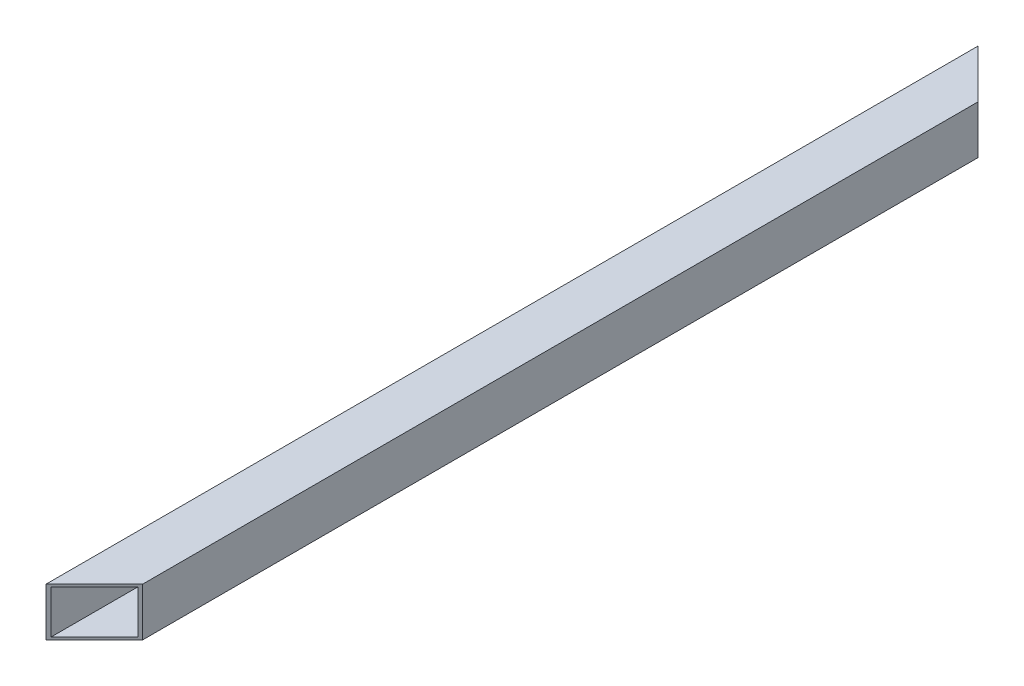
ISO-10303-21;
HEADER;
FILE_DESCRIPTION(('STEP AP214'),'2;1');
FILE_NAME('part.step','',(''),(''),'','','');
FILE_SCHEMA(('AUTOMOTIVE_DESIGN { 1 0 10303 214 1 1 1 1 }'));
ENDSEC;
DATA;
#1=APPLICATION_CONTEXT('core data for automotive mechanical design processes');
#2=APPLICATION_PROTOCOL_DEFINITION('international standard','automotive_design',2000,#1);
#3=PRODUCT_CONTEXT('',#1,'mechanical');
#4=PRODUCT('Part','Part','',(#3));
#5=PRODUCT_RELATED_PRODUCT_CATEGORY('part','',(#4));
#6=PRODUCT_DEFINITION_FORMATION('','',#4);
#7=PRODUCT_DEFINITION_CONTEXT('part definition',#1,'design');
#8=PRODUCT_DEFINITION('design','',#6,#7);
#9=PRODUCT_DEFINITION_SHAPE('','',#8);
#10=(LENGTH_UNIT() NAMED_UNIT(*) SI_UNIT(.MILLI.,.METRE.));
#11=(NAMED_UNIT(*) PLANE_ANGLE_UNIT() SI_UNIT($,.RADIAN.));
#12=(NAMED_UNIT(*) SI_UNIT($,.STERADIAN.) SOLID_ANGLE_UNIT());
#13=UNCERTAINTY_MEASURE_WITH_UNIT(LENGTH_MEASURE(1.E-05),#10,'distance_accuracy_value','');
#14=(GEOMETRIC_REPRESENTATION_CONTEXT(3) GLOBAL_UNCERTAINTY_ASSIGNED_CONTEXT((#13)) GLOBAL_UNIT_ASSIGNED_CONTEXT((#10,
#11,#12)) REPRESENTATION_CONTEXT('',''));
#15=CARTESIAN_POINT('',(0.,0.,0.));
#16=DIRECTION('',(0.,0.,1.));
#17=DIRECTION('',(1.,0.,0.));
#18=AXIS2_PLACEMENT_3D('',#15,#16,#17);
#19=CARTESIAN_POINT('',(-36.,36.,-40.));
#20=DIRECTION('',(1.,0.,0.));
#21=DIRECTION('',(0.,1.,0.));
#22=AXIS2_PLACEMENT_3D('',#19,#20,#21);
#23=PLANE('',#22);
#24=DIRECTION('',(0.,-1.,0.));
#25=VECTOR('',#24,1.);
#26=CARTESIAN_POINT('',(-36.,18.,-36.));
#27=LINE('',#26,#25);
#28=CARTESIAN_POINT('',(-36.,36.,-36.));
#29=VERTEX_POINT('',#28);
#30=CARTESIAN_POINT('',(-36.,-36.,-36.));
#31=VERTEX_POINT('',#30);
#32=EDGE_CURVE('E148',#29,#31,#27,.T.);
#33=ORIENTED_EDGE('',*,*,#32,.F.);
#34=DIRECTION('',(0.,0.,1.));
#35=VECTOR('',#34,1.);
#36=CARTESIAN_POINT('',(-36.,36.,-40.));
#37=LINE('',#36,#35);
#38=CARTESIAN_POINT('',(-36.,36.,1499.138438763));
#39=VERTEX_POINT('',#38);
#40=EDGE_CURVE('E10',#29,#39,#37,.T.);
#41=ORIENTED_EDGE('',*,*,#40,.T.);
#42=DIRECTION('',(0.,1.,0.));
#43=VECTOR('',#42,1.);
#44=CARTESIAN_POINT('',(-36.,18.,1499.138438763));
#45=LINE('',#44,#43);
#46=CARTESIAN_POINT('',(-36.,-36.,1499.138438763));
#47=VERTEX_POINT('',#46);
#48=EDGE_CURVE('E103',#47,#39,#45,.T.);
#49=ORIENTED_EDGE('',*,*,#48,.F.);
#50=DIRECTION('',(0.,0.,1.));
#51=VECTOR('',#50,1.);
#52=CARTESIAN_POINT('',(-36.,-36.,-40.));
#53=LINE('',#52,#51);
#54=EDGE_CURVE('E89',#31,#47,#53,.T.);
#55=ORIENTED_EDGE('',*,*,#54,.F.);
#56=EDGE_LOOP('',(#33,#41,#49,#55));
#57=FACE_BOUND('',#56,.T.);
#58=ADVANCED_FACE('F16',(#57),#23,.T.);
#59=CARTESIAN_POINT('',(36.,36.,-40.));
#60=DIRECTION('',(0.,-1.,0.));
#61=DIRECTION('',(0.,0.,-1.));
#62=AXIS2_PLACEMENT_3D('',#59,#60,#61);
#63=PLANE('',#62);
#64=DIRECTION('',(-0.707106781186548,0.,-0.707106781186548));
#65=VECTOR('',#64,1.);
#66=CARTESIAN_POINT('',(-1.,36.,-1.));
#67=LINE('',#66,#65);
#68=CARTESIAN_POINT('',(36.,36.,36.));
#69=VERTEX_POINT('',#68);
#70=EDGE_CURVE('E144',#69,#29,#67,.T.);
#71=ORIENTED_EDGE('',*,*,#70,.F.);
#72=DIRECTION('',(0.,0.,1.));
#73=VECTOR('',#72,1.);
#74=CARTESIAN_POINT('',(36.,36.,-40.));
#75=LINE('',#74,#73);
#76=CARTESIAN_POINT('',(36.,36.,1427.138438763));
#77=VERTEX_POINT('',#76);
#78=EDGE_CURVE('E24',#69,#77,#75,.T.);
#79=ORIENTED_EDGE('',*,*,#78,.T.);
#80=DIRECTION('',(0.707106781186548,0.,-0.707106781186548));
#81=VECTOR('',#80,1.);
#82=CARTESIAN_POINT('',(750.56921938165,36.,712.56921938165));
#83=LINE('',#82,#81);
#84=EDGE_CURVE('E134',#39,#77,#83,.T.);
#85=ORIENTED_EDGE('',*,*,#84,.F.);
#86=ORIENTED_EDGE('',*,*,#40,.F.);
#87=EDGE_LOOP('',(#71,#79,#85,#86));
#88=FACE_BOUND('',#87,.T.);
#89=ADVANCED_FACE('F208',(#88),#63,.T.);
#90=CARTESIAN_POINT('',(36.,-36.,-40.));
#91=DIRECTION('',(-1.,0.,0.));
#92=DIRECTION('',(0.,0.,1.));
#93=AXIS2_PLACEMENT_3D('',#90,#91,#92);
#94=PLANE('',#93);
#95=DIRECTION('',(0.,1.,0.));
#96=VECTOR('',#95,1.);
#97=CARTESIAN_POINT('',(36.,-18.,36.));
#98=LINE('',#97,#96);
#99=CARTESIAN_POINT('',(36.,-36.,36.));
#100=VERTEX_POINT('',#99);
#101=EDGE_CURVE('E129',#100,#69,#98,.T.);
#102=ORIENTED_EDGE('',*,*,#101,.F.);
#103=DIRECTION('',(0.,0.,1.));
#104=VECTOR('',#103,1.);
#105=CARTESIAN_POINT('',(36.,-36.,-40.));
#106=LINE('',#105,#104);
#107=CARTESIAN_POINT('',(36.,-36.,1427.138438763));
#108=VERTEX_POINT('',#107);
#109=EDGE_CURVE('E36',#100,#108,#106,.T.);
#110=ORIENTED_EDGE('',*,*,#109,.T.);
#111=DIRECTION('',(0.,-1.,0.));
#112=VECTOR('',#111,1.);
#113=CARTESIAN_POINT('',(36.,-18.,1427.138438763));
#114=LINE('',#113,#112);
#115=EDGE_CURVE('E138',#77,#108,#114,.T.);
#116=ORIENTED_EDGE('',*,*,#115,.F.);
#117=ORIENTED_EDGE('',*,*,#78,.F.);
#118=EDGE_LOOP('',(#102,#110,#116,#117));
#119=FACE_BOUND('',#118,.T.);
#120=ADVANCED_FACE('F213',(#119),#94,.T.);
#121=CARTESIAN_POINT('',(-36.,-36.,-40.));
#122=DIRECTION('',(0.,1.,0.));
#123=DIRECTION('',(1.,0.,0.));
#124=AXIS2_PLACEMENT_3D('',#121,#122,#123);
#125=PLANE('',#124);
#126=DIRECTION('',(0.707106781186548,0.,0.707106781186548));
#127=VECTOR('',#126,1.);
#128=CARTESIAN_POINT('',(-19.,-36.,-19.));
#129=LINE('',#128,#127);
#130=EDGE_CURVE('E119',#31,#100,#129,.T.);
#131=ORIENTED_EDGE('',*,*,#130,.F.);
#132=ORIENTED_EDGE('',*,*,#54,.T.);
#133=DIRECTION('',(-0.707106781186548,0.,0.707106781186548));
#134=VECTOR('',#133,1.);
#135=CARTESIAN_POINT('',(732.56921938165,-36.,730.56921938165));
#136=LINE('',#135,#134);
#137=EDGE_CURVE('E90',#108,#47,#136,.T.);
#138=ORIENTED_EDGE('',*,*,#137,.F.);
#139=ORIENTED_EDGE('',*,*,#109,.F.);
#140=EDGE_LOOP('',(#131,#132,#138,#139));
#141=FACE_BOUND('',#140,.T.);
#142=ADVANCED_FACE('F219',(#141),#125,.T.);
#143=CARTESIAN_POINT('',(40.,40.,-40.));
#144=DIRECTION('',(0.,-1.,0.));
#145=DIRECTION('',(0.,0.,-1.));
#146=AXIS2_PLACEMENT_3D('',#143,#144,#145);
#147=PLANE('',#146);
#148=DIRECTION('',(0.,0.,1.));
#149=VECTOR('',#148,1.);
#150=CARTESIAN_POINT('',(-40.,40.,-40.));
#151=LINE('',#150,#149);
#152=CARTESIAN_POINT('',(-40.,40.,-40.));
#153=VERTEX_POINT('',#152);
#154=CARTESIAN_POINT('',(-40.,40.,1503.1384388));
#155=VERTEX_POINT('',#154);
#156=EDGE_CURVE('E75',#153,#155,#151,.T.);
#157=ORIENTED_EDGE('',*,*,#156,.T.);
#158=DIRECTION('',(0.707106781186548,0.,-0.707106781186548));
#159=VECTOR('',#158,1.);
#160=CARTESIAN_POINT('',(751.56921938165,40.,711.56921938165));
#161=LINE('',#160,#159);
#162=CARTESIAN_POINT('',(40.,40.,1423.138438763));
#163=VERTEX_POINT('',#162);
#164=EDGE_CURVE('E80',#155,#163,#161,.T.);
#165=ORIENTED_EDGE('',*,*,#164,.T.);
#166=DIRECTION('',(0.,0.,1.));
#167=VECTOR('',#166,1.);
#168=CARTESIAN_POINT('',(40.,40.,-40.));
#169=LINE('',#168,#167);
#170=CARTESIAN_POINT('',(40.,40.,40.));
#171=VERTEX_POINT('',#170);
#172=EDGE_CURVE('E115',#171,#163,#169,.T.);
#173=ORIENTED_EDGE('',*,*,#172,.F.);
#174=DIRECTION('',(-0.707106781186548,0.,-0.707106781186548));
#175=VECTOR('',#174,1.);
#176=CARTESIAN_POINT('',(0.,40.,0.));
#177=LINE('',#176,#175);
#178=EDGE_CURVE('E84',#171,#153,#177,.T.);
#179=ORIENTED_EDGE('',*,*,#178,.T.);
#180=EDGE_LOOP('',(#157,#165,#173,#179));
#181=FACE_BOUND('',#180,.T.);
#182=ADVANCED_FACE('F77',(#181),#147,.F.);
#183=CARTESIAN_POINT('',(-40.,40.,-40.));
#184=DIRECTION('',(1.,0.,0.));
#185=DIRECTION('',(0.,1.,0.));
#186=AXIS2_PLACEMENT_3D('',#183,#184,#185);
#187=PLANE('',#186);
#188=DIRECTION('',(0.,-1.,0.));
#189=VECTOR('',#188,1.);
#190=CARTESIAN_POINT('',(-40.,40.,-40.));
#191=LINE('',#190,#189);
#192=CARTESIAN_POINT('',(-40.,-40.,-40.));
#193=VERTEX_POINT('',#192);
#194=EDGE_CURVE('E130',#153,#193,#191,.T.);
#195=ORIENTED_EDGE('',*,*,#194,.T.);
#196=DIRECTION('',(0.,0.,1.));
#197=VECTOR('',#196,1.);
#198=CARTESIAN_POINT('',(-40.,-40.,-40.));
#199=LINE('',#198,#197);
#200=CARTESIAN_POINT('',(-40.,-40.,1503.1384388));
#201=VERTEX_POINT('',#200);
#202=EDGE_CURVE('E98',#193,#201,#199,.T.);
#203=ORIENTED_EDGE('',*,*,#202,.T.);
#204=DIRECTION('',(0.,-1.,0.));
#205=VECTOR('',#204,1.);
#206=CARTESIAN_POINT('',(-40.,40.,1503.1384388));
#207=LINE('',#206,#205);
#208=EDGE_CURVE('E94',#155,#201,#207,.T.);
#209=ORIENTED_EDGE('',*,*,#208,.F.);
#210=ORIENTED_EDGE('',*,*,#156,.F.);
#211=EDGE_LOOP('',(#195,#203,#209,#210));
#212=FACE_BOUND('',#211,.T.);
#213=ADVANCED_FACE('F95',(#212),#187,.F.);
#214=CARTESIAN_POINT('',(731.56921938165,0.,731.56921938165));
#215=DIRECTION('',(-0.707106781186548,0.,-0.707106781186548));
#216=DIRECTION('',(-0.707106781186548,0.,0.707106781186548));
#217=AXIS2_PLACEMENT_3D('',#214,#215,#216);
#218=PLANE('',#217);
#219=ORIENTED_EDGE('',*,*,#48,.T.);
#220=ORIENTED_EDGE('',*,*,#84,.T.);
#221=ORIENTED_EDGE('',*,*,#115,.T.);
#222=ORIENTED_EDGE('',*,*,#137,.T.);
#223=EDGE_LOOP('',(#219,#220,#221,#222));
#224=FACE_BOUND('',#223,.T.);
#225=DIRECTION('',(-0.707106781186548,0.,0.707106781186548));
#226=VECTOR('',#225,1.);
#227=CARTESIAN_POINT('',(731.56921938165,-40.,731.56921938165));
#228=LINE('',#227,#226);
#229=CARTESIAN_POINT('',(40.,-40.,1423.138438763));
#230=VERTEX_POINT('',#229);
#231=EDGE_CURVE('E287',#230,#201,#228,.T.);
#232=ORIENTED_EDGE('',*,*,#231,.F.);
#233=DIRECTION('',(0.,-1.,0.));
#234=VECTOR('',#233,1.);
#235=CARTESIAN_POINT('',(40.,-20.,1423.138438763));
#236=LINE('',#235,#234);
#237=EDGE_CURVE('E107',#163,#230,#236,.T.);
#238=ORIENTED_EDGE('',*,*,#237,.F.);
#239=ORIENTED_EDGE('',*,*,#164,.F.);
#240=ORIENTED_EDGE('',*,*,#208,.T.);
#241=EDGE_LOOP('',(#232,#238,#239,#240));
#242=FACE_BOUND('',#241,.T.);
#243=ADVANCED_FACE('F105',(#224,#242),#218,.F.);
#244=CARTESIAN_POINT('',(40.,-40.,-40.));
#245=DIRECTION('',(-1.,0.,0.));
#246=DIRECTION('',(0.,0.,1.));
#247=AXIS2_PLACEMENT_3D('',#244,#245,#246);
#248=PLANE('',#247);
#249=ORIENTED_EDGE('',*,*,#172,.T.);
#250=ORIENTED_EDGE('',*,*,#237,.T.);
#251=DIRECTION('',(0.,0.,1.));
#252=VECTOR('',#251,1.);
#253=CARTESIAN_POINT('',(40.,-40.,-40.));
#254=LINE('',#253,#252);
#255=CARTESIAN_POINT('',(40.,-40.,40.));
#256=VERTEX_POINT('',#255);
#257=EDGE_CURVE('E290',#256,#230,#254,.T.);
#258=ORIENTED_EDGE('',*,*,#257,.F.);
#259=DIRECTION('',(0.,1.,0.));
#260=VECTOR('',#259,1.);
#261=CARTESIAN_POINT('',(40.,-20.,40.));
#262=LINE('',#261,#260);
#263=EDGE_CURVE('E126',#256,#171,#262,.T.);
#264=ORIENTED_EDGE('',*,*,#263,.T.);
#265=EDGE_LOOP('',(#249,#250,#258,#264));
#266=FACE_BOUND('',#265,.T.);
#267=ADVANCED_FACE('F186',(#266),#248,.F.);
#268=CARTESIAN_POINT('',(0.,0.,0.));
#269=DIRECTION('',(-0.707106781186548,0.,0.707106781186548));
#270=DIRECTION('',(0.,1.,0.));
#271=AXIS2_PLACEMENT_3D('',#268,#269,#270);
#272=PLANE('',#271);
#273=ORIENTED_EDGE('',*,*,#101,.T.);
#274=ORIENTED_EDGE('',*,*,#70,.T.);
#275=ORIENTED_EDGE('',*,*,#32,.T.);
#276=ORIENTED_EDGE('',*,*,#130,.T.);
#277=EDGE_LOOP('',(#273,#274,#275,#276));
#278=FACE_BOUND('',#277,.T.);
#279=ORIENTED_EDGE('',*,*,#263,.F.);
#280=DIRECTION('',(0.707106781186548,0.,0.707106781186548));
#281=VECTOR('',#280,1.);
#282=CARTESIAN_POINT('',(-20.,-40.,-20.));
#283=LINE('',#282,#281);
#284=EDGE_CURVE('E122',#193,#256,#283,.T.);
#285=ORIENTED_EDGE('',*,*,#284,.F.);
#286=ORIENTED_EDGE('',*,*,#194,.F.);
#287=ORIENTED_EDGE('',*,*,#178,.F.);
#288=EDGE_LOOP('',(#279,#285,#286,#287));
#289=FACE_BOUND('',#288,.T.);
#290=ADVANCED_FACE('F176',(#278,#289),#272,.F.);
#291=CARTESIAN_POINT('',(-40.,-40.,-40.));
#292=DIRECTION('',(0.,1.,0.));
#293=DIRECTION('',(1.,0.,0.));
#294=AXIS2_PLACEMENT_3D('',#291,#292,#293);
#295=PLANE('',#294);
#296=ORIENTED_EDGE('',*,*,#257,.T.);
#297=ORIENTED_EDGE('',*,*,#231,.T.);
#298=ORIENTED_EDGE('',*,*,#202,.F.);
#299=ORIENTED_EDGE('',*,*,#284,.T.);
#300=EDGE_LOOP('',(#296,#297,#298,#299));
#301=FACE_BOUND('',#300,.T.);
#302=ADVANCED_FACE('F171',(#301),#295,.F.);
#303=CLOSED_SHELL('',(#58,#89,#120,#142,#182,#213,#243,#267,#290,#302));
#304=MANIFOLD_SOLID_BREP('B1',#303);
#305=ADVANCED_BREP_SHAPE_REPRESENTATION('',(#18,#304),#14);
#306=SHAPE_DEFINITION_REPRESENTATION(#9,#305);
ENDSEC;
END-ISO-10303-21;
